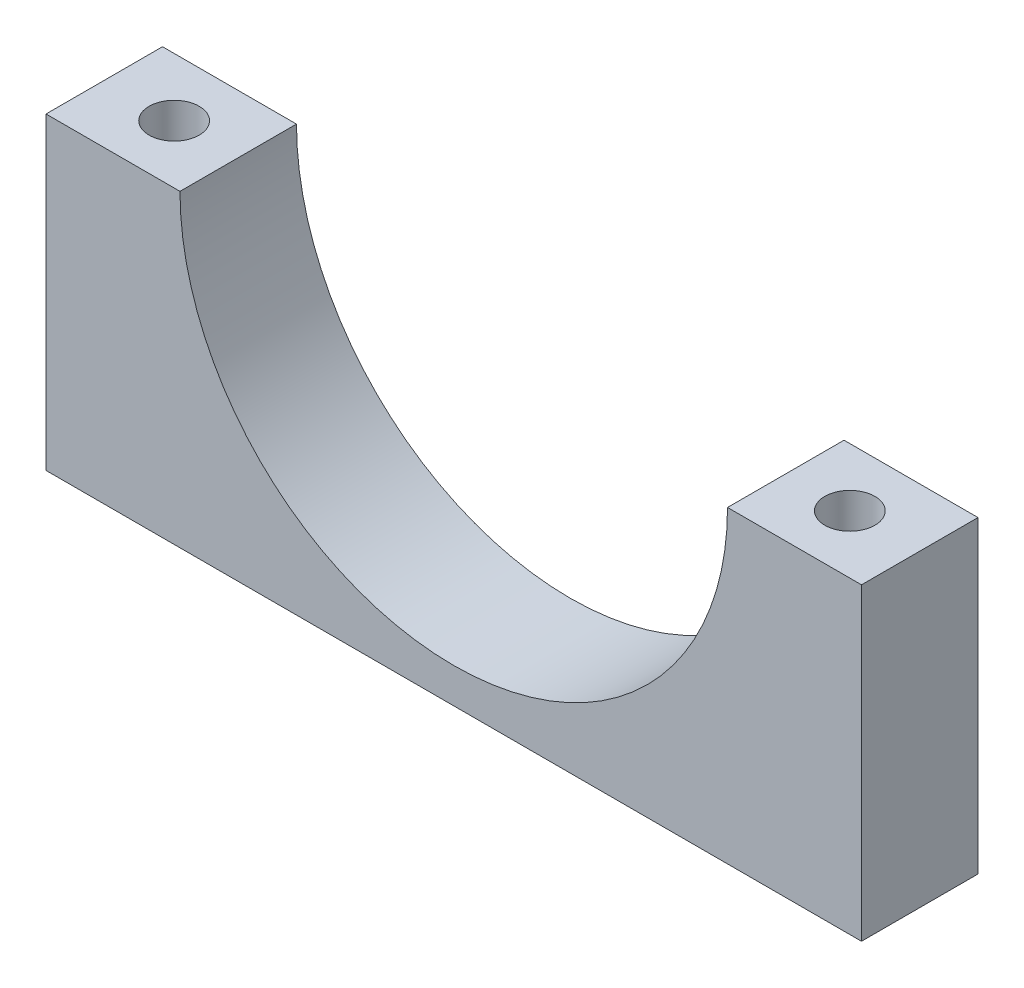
ISO-10303-21;
HEADER;
FILE_DESCRIPTION(('STEP AP214'),'2;1');
FILE_NAME('part.step','',(''),(''),'','','');
FILE_SCHEMA(('AUTOMOTIVE_DESIGN { 1 0 10303 214 1 1 1 1 }'));
ENDSEC;
DATA;
#1=APPLICATION_CONTEXT('core data for automotive mechanical design processes');
#2=APPLICATION_PROTOCOL_DEFINITION('international standard','automotive_design',2000,#1);
#3=PRODUCT_CONTEXT('',#1,'mechanical');
#4=PRODUCT('Part','Part','',(#3));
#5=PRODUCT_RELATED_PRODUCT_CATEGORY('part','',(#4));
#6=PRODUCT_DEFINITION_FORMATION('','',#4);
#7=PRODUCT_DEFINITION_CONTEXT('part definition',#1,'design');
#8=PRODUCT_DEFINITION('design','',#6,#7);
#9=PRODUCT_DEFINITION_SHAPE('','',#8);
#10=(LENGTH_UNIT() NAMED_UNIT(*) SI_UNIT(.MILLI.,.METRE.));
#11=(NAMED_UNIT(*) PLANE_ANGLE_UNIT() SI_UNIT($,.RADIAN.));
#12=(NAMED_UNIT(*) SI_UNIT($,.STERADIAN.) SOLID_ANGLE_UNIT());
#13=UNCERTAINTY_MEASURE_WITH_UNIT(LENGTH_MEASURE(1.E-05),#10,'distance_accuracy_value','');
#14=(GEOMETRIC_REPRESENTATION_CONTEXT(3) GLOBAL_UNCERTAINTY_ASSIGNED_CONTEXT((#13)) GLOBAL_UNIT_ASSIGNED_CONTEXT((#10,
#11,#12)) REPRESENTATION_CONTEXT('',''));
#15=CARTESIAN_POINT('',(0.,0.,0.));
#16=DIRECTION('',(0.,0.,1.));
#17=DIRECTION('',(1.,0.,0.));
#18=AXIS2_PLACEMENT_3D('',#15,#16,#17);
#19=CARTESIAN_POINT('',(-74.,-25.,-84.8481796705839));
#20=DIRECTION('',(0.,0.,1.));
#21=DIRECTION('',(1.,0.,0.));
#22=AXIS2_PLACEMENT_3D('',#19,#20,#21);
#23=CYLINDRICAL_SURFACE('',#22,23.5);
#24=CARTESIAN_POINT('',(-74.,-25.,-9.99999999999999));
#25=DIRECTION('',(0.,0.,1.));
#26=DIRECTION('',(1.,0.,0.));
#27=AXIS2_PLACEMENT_3D('',#24,#25,#26);
#28=CIRCLE('',#27,23.5);
#29=CARTESIAN_POINT('',(-97.5,-25.,-9.99999999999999));
#30=VERTEX_POINT('',#29);
#31=CARTESIAN_POINT('',(-50.5,-25.,-9.99999999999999));
#32=VERTEX_POINT('',#31);
#33=EDGE_CURVE('E41',#30,#32,#28,.T.);
#34=ORIENTED_EDGE('',*,*,#33,.F.);
#35=DIRECTION('',(0.,0.,1.));
#36=VECTOR('',#35,1.);
#37=CARTESIAN_POINT('',(-97.5,-25.,-84.8481796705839));
#38=LINE('',#37,#36);
#39=CARTESIAN_POINT('',(-97.5,-25.,0.));
#40=VERTEX_POINT('',#39);
#41=EDGE_CURVE('E97',#30,#40,#38,.T.);
#42=ORIENTED_EDGE('',*,*,#41,.T.);
#43=CARTESIAN_POINT('',(-74.,-25.,0.));
#44=DIRECTION('',(0.,0.,-1.));
#45=DIRECTION('',(-1.,0.,0.));
#46=AXIS2_PLACEMENT_3D('',#43,#44,#45);
#47=CIRCLE('',#46,23.5);
#48=CARTESIAN_POINT('',(-50.5,-25.,0.));
#49=VERTEX_POINT('',#48);
#50=EDGE_CURVE('E125',#49,#40,#47,.T.);
#51=ORIENTED_EDGE('',*,*,#50,.F.);
#52=DIRECTION('',(0.,0.,1.));
#53=VECTOR('',#52,1.);
#54=CARTESIAN_POINT('',(-50.5,-25.,-84.8481796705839));
#55=LINE('',#54,#53);
#56=EDGE_CURVE('E90',#32,#49,#55,.T.);
#57=ORIENTED_EDGE('',*,*,#56,.F.);
#58=EDGE_LOOP('',(#34,#42,#51,#57));
#59=FACE_BOUND('',#58,.T.);
#60=ADVANCED_FACE('F33',(#59),#23,.F.);
#61=CARTESIAN_POINT('',(-50.5,-25.,-84.8481796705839));
#62=DIRECTION('',(0.,1.,0.));
#63=DIRECTION('',(-1.,0.,0.));
#64=AXIS2_PLACEMENT_3D('',#61,#62,#63);
#65=PLANE('',#64);
#66=CARTESIAN_POINT('',(-45.,-25.,-5.));
#67=DIRECTION('',(0.,-1.,0.));
#68=DIRECTION('',(0.,0.,-1.));
#69=AXIS2_PLACEMENT_3D('',#66,#67,#68);
#70=CIRCLE('',#69,2.14999999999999);
#71=CARTESIAN_POINT('',(-45.,-25.,-7.14999999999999));
#72=VERTEX_POINT('',#71);
#73=EDGE_CURVE('E199',#72,#72,#70,.T.);
#74=ORIENTED_EDGE('',*,*,#73,.T.);
#75=EDGE_LOOP('',(#74));
#76=FACE_BOUND('',#75,.T.);
#77=DIRECTION('',(1.,0.,0.));
#78=VECTOR('',#77,1.);
#79=CARTESIAN_POINT('',(-50.5,-25.,-9.99999999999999));
#80=LINE('',#79,#78);
#81=CARTESIAN_POINT('',(-39.,-25.,-9.99999999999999));
#82=VERTEX_POINT('',#81);
#83=EDGE_CURVE('E66',#32,#82,#80,.T.);
#84=ORIENTED_EDGE('',*,*,#83,.F.);
#85=ORIENTED_EDGE('',*,*,#56,.T.);
#86=DIRECTION('',(-1.,0.,0.));
#87=VECTOR('',#86,1.);
#88=CARTESIAN_POINT('',(-50.5,-25.,0.));
#89=LINE('',#88,#87);
#90=CARTESIAN_POINT('',(-39.,-25.,0.));
#91=VERTEX_POINT('',#90);
#92=EDGE_CURVE('E99',#91,#49,#89,.T.);
#93=ORIENTED_EDGE('',*,*,#92,.F.);
#94=DIRECTION('',(0.,0.,1.));
#95=VECTOR('',#94,1.);
#96=CARTESIAN_POINT('',(-39.,-25.,-84.8481796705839));
#97=LINE('',#96,#95);
#98=EDGE_CURVE('E88',#82,#91,#97,.T.);
#99=ORIENTED_EDGE('',*,*,#98,.F.);
#100=EDGE_LOOP('',(#84,#85,#93,#99));
#101=FACE_BOUND('',#100,.T.);
#102=ADVANCED_FACE('F143',(#76,#101),#65,.T.);
#103=CARTESIAN_POINT('',(-39.,-25.,-84.8481796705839));
#104=DIRECTION('',(1.,0.,0.));
#105=DIRECTION('',(0.,1.,0.));
#106=AXIS2_PLACEMENT_3D('',#103,#104,#105);
#107=PLANE('',#106);
#108=DIRECTION('',(0.,-1.,0.));
#109=VECTOR('',#108,1.);
#110=CARTESIAN_POINT('',(-39.,-25.,-9.99999999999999));
#111=LINE('',#110,#109);
#112=CARTESIAN_POINT('',(-39.,-51.5,-9.99999999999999));
#113=VERTEX_POINT('',#112);
#114=EDGE_CURVE('E60',#82,#113,#111,.T.);
#115=ORIENTED_EDGE('',*,*,#114,.F.);
#116=ORIENTED_EDGE('',*,*,#98,.T.);
#117=DIRECTION('',(0.,1.,0.));
#118=VECTOR('',#117,1.);
#119=CARTESIAN_POINT('',(-39.,-25.,0.));
#120=LINE('',#119,#118);
#121=CARTESIAN_POINT('',(-39.,-51.5,0.));
#122=VERTEX_POINT('',#121);
#123=EDGE_CURVE('E86',#122,#91,#120,.T.);
#124=ORIENTED_EDGE('',*,*,#123,.F.);
#125=DIRECTION('',(0.,0.,1.));
#126=VECTOR('',#125,1.);
#127=CARTESIAN_POINT('',(-39.,-51.5,-84.8481796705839));
#128=LINE('',#127,#126);
#129=EDGE_CURVE('E78',#113,#122,#128,.T.);
#130=ORIENTED_EDGE('',*,*,#129,.F.);
#131=EDGE_LOOP('',(#115,#116,#124,#130));
#132=FACE_BOUND('',#131,.T.);
#133=ADVANCED_FACE('F84',(#132),#107,.T.);
#134=CARTESIAN_POINT('',(-39.,-51.5,-84.8481796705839));
#135=DIRECTION('',(0.,-1.,0.));
#136=DIRECTION('',(0.,0.,-1.));
#137=AXIS2_PLACEMENT_3D('',#134,#135,#136);
#138=PLANE('',#137);
#139=CARTESIAN_POINT('',(-45.,-51.5,-5.));
#140=DIRECTION('',(0.,-1.,0.));
#141=DIRECTION('',(0.,0.,-1.));
#142=AXIS2_PLACEMENT_3D('',#139,#140,#141);
#143=CIRCLE('',#142,4.);
#144=CARTESIAN_POINT('',(-45.,-51.5,-9.));
#145=VERTEX_POINT('',#144);
#146=EDGE_CURVE('E206',#145,#145,#143,.T.);
#147=ORIENTED_EDGE('',*,*,#146,.F.);
#148=EDGE_LOOP('',(#147));
#149=FACE_BOUND('',#148,.T.);
#150=CARTESIAN_POINT('',(-103.,-51.5,-5.));
#151=DIRECTION('',(0.,-1.,0.));
#152=DIRECTION('',(0.,0.,-1.));
#153=AXIS2_PLACEMENT_3D('',#150,#151,#152);
#154=CIRCLE('',#153,4.);
#155=CARTESIAN_POINT('',(-103.,-51.5,-9.00000000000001));
#156=VERTEX_POINT('',#155);
#157=EDGE_CURVE('E120',#156,#156,#154,.T.);
#158=ORIENTED_EDGE('',*,*,#157,.F.);
#159=EDGE_LOOP('',(#158));
#160=FACE_BOUND('',#159,.T.);
#161=DIRECTION('',(-1.,0.,0.));
#162=VECTOR('',#161,1.);
#163=CARTESIAN_POINT('',(-39.,-51.5,-9.99999999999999));
#164=LINE('',#163,#162);
#165=CARTESIAN_POINT('',(-109.,-51.5,-9.99999999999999));
#166=VERTEX_POINT('',#165);
#167=EDGE_CURVE('E63',#113,#166,#164,.T.);
#168=ORIENTED_EDGE('',*,*,#167,.F.);
#169=ORIENTED_EDGE('',*,*,#129,.T.);
#170=DIRECTION('',(1.,0.,0.));
#171=VECTOR('',#170,1.);
#172=CARTESIAN_POINT('',(-39.,-51.5,0.));
#173=LINE('',#172,#171);
#174=CARTESIAN_POINT('',(-109.,-51.5,0.));
#175=VERTEX_POINT('',#174);
#176=EDGE_CURVE('E111',#175,#122,#173,.T.);
#177=ORIENTED_EDGE('',*,*,#176,.F.);
#178=DIRECTION('',(0.,0.,1.));
#179=VECTOR('',#178,1.);
#180=CARTESIAN_POINT('',(-109.,-51.5,-84.8481796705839));
#181=LINE('',#180,#179);
#182=EDGE_CURVE('E81',#166,#175,#181,.T.);
#183=ORIENTED_EDGE('',*,*,#182,.F.);
#184=EDGE_LOOP('',(#168,#169,#177,#183));
#185=FACE_BOUND('',#184,.T.);
#186=ADVANCED_FACE('F75',(#149,#160,#185),#138,.T.);
#187=CARTESIAN_POINT('',(-109.,-51.5,-84.8481796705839));
#188=DIRECTION('',(-1.,0.,0.));
#189=DIRECTION('',(0.,-1.,0.));
#190=AXIS2_PLACEMENT_3D('',#187,#188,#189);
#191=PLANE('',#190);
#192=DIRECTION('',(0.,1.,0.));
#193=VECTOR('',#192,1.);
#194=CARTESIAN_POINT('',(-109.,-51.5,-9.99999999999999));
#195=LINE('',#194,#193);
#196=CARTESIAN_POINT('',(-109.,-25.,-10.));
#197=VERTEX_POINT('',#196);
#198=EDGE_CURVE('E82',#166,#197,#195,.T.);
#199=ORIENTED_EDGE('',*,*,#198,.F.);
#200=ORIENTED_EDGE('',*,*,#182,.T.);
#201=DIRECTION('',(0.,-1.,0.));
#202=VECTOR('',#201,1.);
#203=CARTESIAN_POINT('',(-109.,-51.5,0.));
#204=LINE('',#203,#202);
#205=CARTESIAN_POINT('',(-109.,-25.,0.));
#206=VERTEX_POINT('',#205);
#207=EDGE_CURVE('E130',#206,#175,#204,.T.);
#208=ORIENTED_EDGE('',*,*,#207,.F.);
#209=DIRECTION('',(0.,0.,1.));
#210=VECTOR('',#209,1.);
#211=CARTESIAN_POINT('',(-109.,-25.,-84.8481796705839));
#212=LINE('',#211,#210);
#213=EDGE_CURVE('E92',#197,#206,#212,.T.);
#214=ORIENTED_EDGE('',*,*,#213,.F.);
#215=EDGE_LOOP('',(#199,#200,#208,#214));
#216=FACE_BOUND('',#215,.T.);
#217=ADVANCED_FACE('F146',(#216),#191,.T.);
#218=CARTESIAN_POINT('',(-109.,-25.,-84.8481796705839));
#219=DIRECTION('',(0.,1.,0.));
#220=DIRECTION('',(0.,0.,1.));
#221=AXIS2_PLACEMENT_3D('',#218,#219,#220);
#222=PLANE('',#221);
#223=CARTESIAN_POINT('',(-103.,-25.,-5.));
#224=DIRECTION('',(0.,-1.,0.));
#225=DIRECTION('',(0.,0.,-1.));
#226=AXIS2_PLACEMENT_3D('',#223,#224,#225);
#227=CIRCLE('',#226,2.15);
#228=CARTESIAN_POINT('',(-103.,-25.,-7.15));
#229=VERTEX_POINT('',#228);
#230=EDGE_CURVE('E212',#229,#229,#227,.T.);
#231=ORIENTED_EDGE('',*,*,#230,.T.);
#232=EDGE_LOOP('',(#231));
#233=FACE_BOUND('',#232,.T.);
#234=DIRECTION('',(1.,0.,0.));
#235=VECTOR('',#234,1.);
#236=CARTESIAN_POINT('',(-109.,-25.,-9.99999999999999));
#237=LINE('',#236,#235);
#238=EDGE_CURVE('E11',#197,#30,#237,.T.);
#239=ORIENTED_EDGE('',*,*,#238,.F.);
#240=ORIENTED_EDGE('',*,*,#213,.T.);
#241=DIRECTION('',(-1.,0.,0.));
#242=VECTOR('',#241,1.);
#243=CARTESIAN_POINT('',(-109.,-25.,0.));
#244=LINE('',#243,#242);
#245=EDGE_CURVE('E127',#40,#206,#244,.T.);
#246=ORIENTED_EDGE('',*,*,#245,.F.);
#247=ORIENTED_EDGE('',*,*,#41,.F.);
#248=EDGE_LOOP('',(#239,#240,#246,#247));
#249=FACE_BOUND('',#248,.T.);
#250=ADVANCED_FACE('F145',(#233,#249),#222,.T.);
#251=CARTESIAN_POINT('',(-74.,-25.,0.));
#252=DIRECTION('',(0.,0.,-1.));
#253=DIRECTION('',(-1.,0.,0.));
#254=AXIS2_PLACEMENT_3D('',#251,#252,#253);
#255=PLANE('',#254);
#256=ORIENTED_EDGE('',*,*,#50,.T.);
#257=ORIENTED_EDGE('',*,*,#245,.T.);
#258=ORIENTED_EDGE('',*,*,#207,.T.);
#259=ORIENTED_EDGE('',*,*,#176,.T.);
#260=ORIENTED_EDGE('',*,*,#123,.T.);
#261=ORIENTED_EDGE('',*,*,#92,.T.);
#262=EDGE_LOOP('',(#256,#257,#258,#259,#260,#261));
#263=FACE_BOUND('',#262,.T.);
#264=ADVANCED_FACE('F132',(#263),#255,.F.);
#265=CARTESIAN_POINT('',(-109.,-95.7106781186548,-9.99999999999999));
#266=DIRECTION('',(0.,0.,1.));
#267=DIRECTION('',(1.,0.,0.));
#268=AXIS2_PLACEMENT_3D('',#265,#266,#267);
#269=PLANE('',#268);
#270=ORIENTED_EDGE('',*,*,#33,.T.);
#271=ORIENTED_EDGE('',*,*,#83,.T.);
#272=ORIENTED_EDGE('',*,*,#114,.T.);
#273=ORIENTED_EDGE('',*,*,#167,.T.);
#274=ORIENTED_EDGE('',*,*,#198,.T.);
#275=ORIENTED_EDGE('',*,*,#238,.T.);
#276=EDGE_LOOP('',(#270,#271,#272,#273,#274,#275));
#277=FACE_BOUND('',#276,.T.);
#278=ADVANCED_FACE('F62',(#277),#269,.F.);
#279=CARTESIAN_POINT('',(-103.,-51.5,-5.));
#280=DIRECTION('',(0.,-1.,0.));
#281=DIRECTION('',(0.,0.,-1.));
#282=AXIS2_PLACEMENT_3D('',#279,#280,#281);
#283=CYLINDRICAL_SURFACE('',#282,4.);
#284=CARTESIAN_POINT('',(-103.,-47.5,-5.));
#285=DIRECTION('',(0.,-1.,0.));
#286=DIRECTION('',(0.,0.,-1.));
#287=AXIS2_PLACEMENT_3D('',#284,#285,#286);
#288=CIRCLE('',#287,4.);
#289=CARTESIAN_POINT('',(-103.,-47.5,-9.00000000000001));
#290=VERTEX_POINT('',#289);
#291=EDGE_CURVE('E217',#290,#290,#288,.T.);
#292=ORIENTED_EDGE('',*,*,#291,.F.);
#293=EDGE_LOOP('',(#292));
#294=FACE_BOUND('',#293,.T.);
#295=ORIENTED_EDGE('',*,*,#157,.T.);
#296=EDGE_LOOP('',(#295));
#297=FACE_BOUND('',#296,.T.);
#298=ADVANCED_FACE('F172',(#294,#297),#283,.F.);
#299=CARTESIAN_POINT('',(-100.85,-47.5,-5.));
#300=DIRECTION('',(0.,1.,0.));
#301=DIRECTION('',(0.,0.,1.));
#302=AXIS2_PLACEMENT_3D('',#299,#300,#301);
#303=PLANE('',#302);
#304=CARTESIAN_POINT('',(-103.,-47.5,-5.));
#305=DIRECTION('',(0.,-1.,0.));
#306=DIRECTION('',(0.,0.,-1.));
#307=AXIS2_PLACEMENT_3D('',#304,#305,#306);
#308=CIRCLE('',#307,2.15);
#309=CARTESIAN_POINT('',(-103.,-47.5,-7.15));
#310=VERTEX_POINT('',#309);
#311=EDGE_CURVE('E215',#310,#310,#308,.T.);
#312=ORIENTED_EDGE('',*,*,#311,.F.);
#313=EDGE_LOOP('',(#312));
#314=FACE_BOUND('',#313,.T.);
#315=ORIENTED_EDGE('',*,*,#291,.T.);
#316=EDGE_LOOP('',(#315));
#317=FACE_BOUND('',#316,.T.);
#318=ADVANCED_FACE('F175',(#314,#317),#303,.F.);
#319=CARTESIAN_POINT('',(-103.,-51.5,-5.));
#320=DIRECTION('',(0.,-1.,0.));
#321=DIRECTION('',(0.,0.,-1.));
#322=AXIS2_PLACEMENT_3D('',#319,#320,#321);
#323=CYLINDRICAL_SURFACE('',#322,2.15);
#324=ORIENTED_EDGE('',*,*,#230,.F.);
#325=EDGE_LOOP('',(#324));
#326=FACE_BOUND('',#325,.T.);
#327=ORIENTED_EDGE('',*,*,#311,.T.);
#328=EDGE_LOOP('',(#327));
#329=FACE_BOUND('',#328,.T.);
#330=ADVANCED_FACE('F179',(#326,#329),#323,.F.);
#331=CARTESIAN_POINT('',(-45.,-51.5,-5.));
#332=DIRECTION('',(0.,-1.,0.));
#333=DIRECTION('',(0.,0.,-1.));
#334=AXIS2_PLACEMENT_3D('',#331,#332,#333);
#335=CYLINDRICAL_SURFACE('',#334,4.);
#336=CARTESIAN_POINT('',(-45.,-47.5,-5.));
#337=DIRECTION('',(0.,-1.,0.));
#338=DIRECTION('',(0.,0.,-1.));
#339=AXIS2_PLACEMENT_3D('',#336,#337,#338);
#340=CIRCLE('',#339,4.);
#341=CARTESIAN_POINT('',(-45.,-47.5,-9.));
#342=VERTEX_POINT('',#341);
#343=EDGE_CURVE('E203',#342,#342,#340,.T.);
#344=ORIENTED_EDGE('',*,*,#343,.F.);
#345=EDGE_LOOP('',(#344));
#346=FACE_BOUND('',#345,.T.);
#347=ORIENTED_EDGE('',*,*,#146,.T.);
#348=EDGE_LOOP('',(#347));
#349=FACE_BOUND('',#348,.T.);
#350=ADVANCED_FACE('F183',(#346,#349),#335,.F.);
#351=CARTESIAN_POINT('',(-42.85,-47.5,-5.));
#352=DIRECTION('',(0.,1.,0.));
#353=DIRECTION('',(0.,0.,1.));
#354=AXIS2_PLACEMENT_3D('',#351,#352,#353);
#355=PLANE('',#354);
#356=CARTESIAN_POINT('',(-45.,-47.5,-5.));
#357=DIRECTION('',(0.,-1.,0.));
#358=DIRECTION('',(0.,0.,-1.));
#359=AXIS2_PLACEMENT_3D('',#356,#357,#358);
#360=CIRCLE('',#359,2.15);
#361=CARTESIAN_POINT('',(-45.,-47.5,-7.15));
#362=VERTEX_POINT('',#361);
#363=EDGE_CURVE('E202',#362,#362,#360,.T.);
#364=ORIENTED_EDGE('',*,*,#363,.F.);
#365=EDGE_LOOP('',(#364));
#366=FACE_BOUND('',#365,.T.);
#367=ORIENTED_EDGE('',*,*,#343,.T.);
#368=EDGE_LOOP('',(#367));
#369=FACE_BOUND('',#368,.T.);
#370=ADVANCED_FACE('F187',(#366,#369),#355,.F.);
#371=CARTESIAN_POINT('',(-45.,-51.5,-5.));
#372=DIRECTION('',(0.,-1.,0.));
#373=DIRECTION('',(0.,0.,-1.));
#374=AXIS2_PLACEMENT_3D('',#371,#372,#373);
#375=CYLINDRICAL_SURFACE('',#374,2.15);
#376=ORIENTED_EDGE('',*,*,#73,.F.);
#377=EDGE_LOOP('',(#376));
#378=FACE_BOUND('',#377,.T.);
#379=ORIENTED_EDGE('',*,*,#363,.T.);
#380=EDGE_LOOP('',(#379));
#381=FACE_BOUND('',#380,.T.);
#382=ADVANCED_FACE('F191',(#378,#381),#375,.F.);
#383=CLOSED_SHELL('',(#60,#102,#133,#186,#217,#250,#264,#278,#298,#318,#330,#350,#370,#382));
#384=MANIFOLD_SOLID_BREP('B2',#383);
#385=ADVANCED_BREP_SHAPE_REPRESENTATION('',(#18,#384),#14);
#386=SHAPE_DEFINITION_REPRESENTATION(#9,#385);
ENDSEC;
END-ISO-10303-21;
